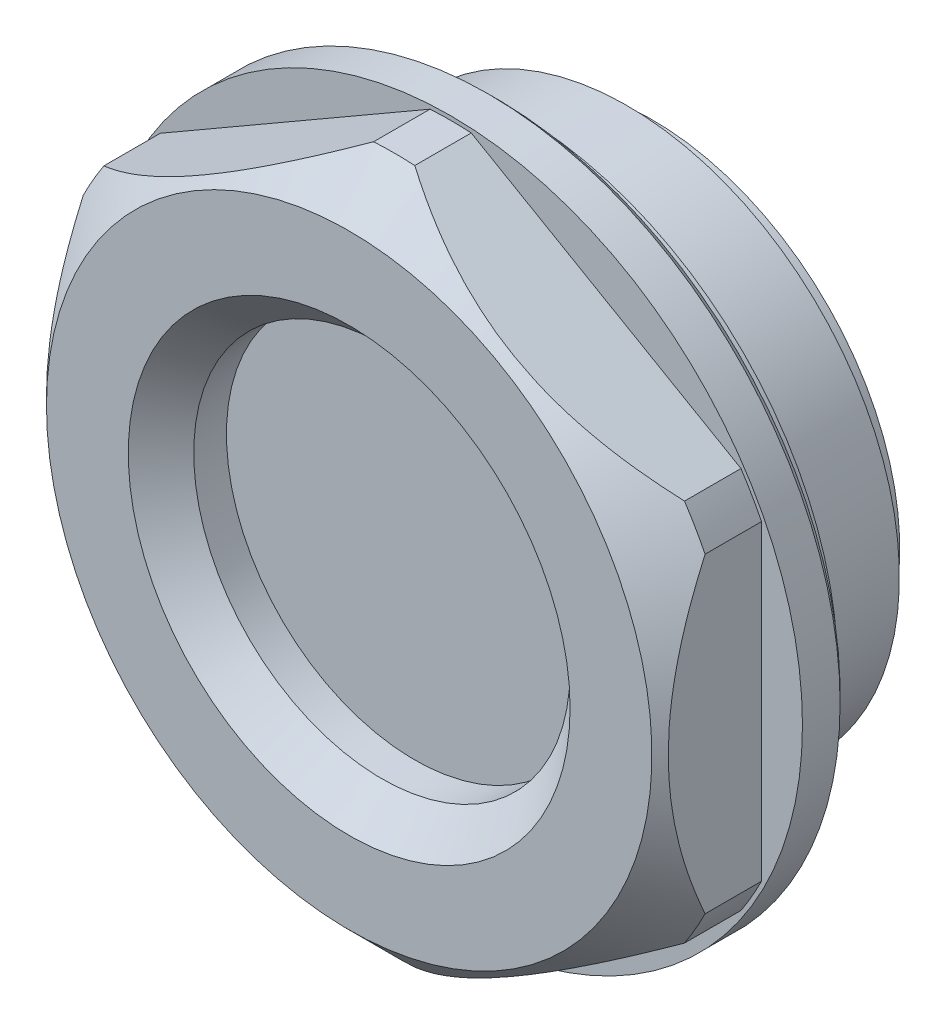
ISO-10303-21;
HEADER;
FILE_DESCRIPTION(('STEP AP214'),'2;1');
FILE_NAME('part.step','',(''),(''),'','','');
FILE_SCHEMA(('AUTOMOTIVE_DESIGN { 1 0 10303 214 1 1 1 1 }'));
ENDSEC;
DATA;
#1=APPLICATION_CONTEXT('core data for automotive mechanical design processes');
#2=APPLICATION_PROTOCOL_DEFINITION('international standard','automotive_design',2000,#1);
#3=PRODUCT_CONTEXT('',#1,'mechanical');
#4=PRODUCT('Part','Part','',(#3));
#5=PRODUCT_RELATED_PRODUCT_CATEGORY('part','',(#4));
#6=PRODUCT_DEFINITION_FORMATION('','',#4);
#7=PRODUCT_DEFINITION_CONTEXT('part definition',#1,'design');
#8=PRODUCT_DEFINITION('design','',#6,#7);
#9=PRODUCT_DEFINITION_SHAPE('','',#8);
#10=(LENGTH_UNIT() NAMED_UNIT(*) SI_UNIT(.MILLI.,.METRE.));
#11=(NAMED_UNIT(*) PLANE_ANGLE_UNIT() SI_UNIT($,.RADIAN.));
#12=(NAMED_UNIT(*) SI_UNIT($,.STERADIAN.) SOLID_ANGLE_UNIT());
#13=UNCERTAINTY_MEASURE_WITH_UNIT(LENGTH_MEASURE(1.E-05),#10,'distance_accuracy_value','');
#14=(GEOMETRIC_REPRESENTATION_CONTEXT(3) GLOBAL_UNCERTAINTY_ASSIGNED_CONTEXT((#13)) GLOBAL_UNIT_ASSIGNED_CONTEXT((#10,
#11,#12)) REPRESENTATION_CONTEXT('',''));
#15=CARTESIAN_POINT('',(0.,0.,0.));
#16=DIRECTION('',(0.,0.,1.));
#17=DIRECTION('',(1.,0.,0.));
#18=AXIS2_PLACEMENT_3D('',#15,#16,#17);
#19=CARTESIAN_POINT('',(0.,0.,-16.2872303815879));
#20=DIRECTION('',(0.,0.,-1.));
#21=DIRECTION('',(-1.,0.,0.));
#22=AXIS2_PLACEMENT_3D('',#19,#20,#21);
#23=CYLINDRICAL_SURFACE('',#22,21.25);
#24=CARTESIAN_POINT('',(0.,0.,7.45));
#25=DIRECTION('',(0.,0.,-1.));
#26=DIRECTION('',(-1.,0.,0.));
#27=AXIS2_PLACEMENT_3D('',#24,#25,#26);
#28=CIRCLE('',#27,21.25);
#29=CARTESIAN_POINT('',(1.25852709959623,-21.2126992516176,7.45));
#30=VERTEX_POINT('',#29);
#31=CARTESIAN_POINT('',(-1.25852709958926,-21.2126992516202,7.45));
#32=VERTEX_POINT('',#31);
#33=EDGE_CURVE('E146',#30,#32,#28,.T.);
#34=ORIENTED_EDGE('',*,*,#33,.T.);
#35=DIRECTION('',(0.,0.,1.));
#36=VECTOR('',#35,1.);
#37=CARTESIAN_POINT('',(-1.25852709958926,-21.2126992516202,3.9999999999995));
#38=LINE('',#37,#36);
#39=CARTESIAN_POINT('',(-1.25852709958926,-21.2126992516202,3.9999999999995));
#40=VERTEX_POINT('',#39);
#41=EDGE_CURVE('E126',#40,#32,#38,.T.);
#42=ORIENTED_EDGE('',*,*,#41,.F.);
#43=CARTESIAN_POINT('',(0.,0.,4.));
#44=DIRECTION('',(0.,0.,-1.));
#45=DIRECTION('',(-1.,0.,0.));
#46=AXIS2_PLACEMENT_3D('',#43,#44,#45);
#47=CIRCLE('',#46,21.25);
#48=CARTESIAN_POINT('',(1.25852709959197,-21.21269925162,3.9999999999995));
#49=VERTEX_POINT('',#48);
#50=EDGE_CURVE('E119',#49,#40,#47,.T.);
#51=ORIENTED_EDGE('',*,*,#50,.F.);
#52=DIRECTION('',(0.,0.,1.));
#53=VECTOR('',#52,1.);
#54=CARTESIAN_POINT('',(1.25852709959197,-21.21269925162,3.9999999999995));
#55=LINE('',#54,#53);
#56=EDGE_CURVE('E100',#49,#30,#55,.T.);
#57=ORIENTED_EDGE('',*,*,#56,.T.);
#58=EDGE_LOOP('',(#34,#42,#51,#57));
#59=FACE_BOUND('',#58,.T.);
#60=ADVANCED_FACE('F14',(#59),#23,.T.);
#61=CARTESIAN_POINT('',(-17.7414728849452,-11.696266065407,3.9999999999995));
#62=VERTEX_POINT('',#61);
#63=CARTESIAN_POINT('',(-18.9999999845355,-9.51643318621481,3.9999999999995));
#64=VERTEX_POINT('',#63);
#65=EDGE_CURVE('E127',#62,#64,#47,.T.);
#66=ORIENTED_EDGE('',*,*,#65,.F.);
#67=DIRECTION('',(0.,0.,1.));
#68=VECTOR('',#67,1.);
#69=CARTESIAN_POINT('',(-17.7414728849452,-11.696266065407,3.9999999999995));
#70=LINE('',#69,#68);
#71=CARTESIAN_POINT('',(-17.7414728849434,-11.696266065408,7.45));
#72=VERTEX_POINT('',#71);
#73=EDGE_CURVE('E302',#62,#72,#70,.T.);
#74=ORIENTED_EDGE('',*,*,#73,.T.);
#75=CARTESIAN_POINT('',(-18.9999999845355,-9.51643318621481,7.45));
#76=VERTEX_POINT('',#75);
#77=EDGE_CURVE('E134',#72,#76,#28,.T.);
#78=ORIENTED_EDGE('',*,*,#77,.T.);
#79=DIRECTION('',(0.,0.,1.));
#80=VECTOR('',#79,1.);
#81=CARTESIAN_POINT('',(-18.9999999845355,-9.51643318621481,3.9999999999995));
#82=LINE('',#81,#80);
#83=EDGE_CURVE('E303',#64,#76,#82,.T.);
#84=ORIENTED_EDGE('',*,*,#83,.F.);
#85=EDGE_LOOP('',(#66,#74,#78,#84));
#86=FACE_BOUND('',#85,.T.);
#87=ADVANCED_FACE('F290',(#86),#23,.T.);
#88=CARTESIAN_POINT('',(-18.9999999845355,9.51643318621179,3.9999999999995));
#89=VERTEX_POINT('',#88);
#90=CARTESIAN_POINT('',(-17.7414728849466,11.6962660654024,3.9999999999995));
#91=VERTEX_POINT('',#90);
#92=EDGE_CURVE('E132',#89,#91,#47,.T.);
#93=ORIENTED_EDGE('',*,*,#92,.F.);
#94=DIRECTION('',(0.,0.,1.));
#95=VECTOR('',#94,1.);
#96=CARTESIAN_POINT('',(-18.9999999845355,9.51643318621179,3.9999999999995));
#97=LINE('',#96,#95);
#98=CARTESIAN_POINT('',(-18.9999999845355,9.51643318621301,7.45));
#99=VERTEX_POINT('',#98);
#100=EDGE_CURVE('E324',#89,#99,#97,.T.);
#101=ORIENTED_EDGE('',*,*,#100,.T.);
#102=CARTESIAN_POINT('',(-17.7414728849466,11.6962660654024,7.45));
#103=VERTEX_POINT('',#102);
#104=EDGE_CURVE('E22',#99,#103,#28,.T.);
#105=ORIENTED_EDGE('',*,*,#104,.T.);
#106=DIRECTION('',(0.,0.,1.));
#107=VECTOR('',#106,1.);
#108=CARTESIAN_POINT('',(-17.7414728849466,11.6962660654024,3.9999999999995));
#109=LINE('',#108,#107);
#110=EDGE_CURVE('E322',#91,#103,#109,.T.);
#111=ORIENTED_EDGE('',*,*,#110,.F.);
#112=EDGE_LOOP('',(#93,#101,#105,#111));
#113=FACE_BOUND('',#112,.T.);
#114=ADVANCED_FACE('F295',(#113),#23,.T.);
#115=CARTESIAN_POINT('',(-1.25852709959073,21.212699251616,3.9999999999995));
#116=VERTEX_POINT('',#115);
#117=CARTESIAN_POINT('',(1.2585270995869,21.212699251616,3.9999999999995));
#118=VERTEX_POINT('',#117);
#119=EDGE_CURVE('E135',#116,#118,#47,.T.);
#120=ORIENTED_EDGE('',*,*,#119,.F.);
#121=DIRECTION('',(0.,0.,1.));
#122=VECTOR('',#121,1.);
#123=CARTESIAN_POINT('',(-1.25852709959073,21.212699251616,3.9999999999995));
#124=LINE('',#123,#122);
#125=CARTESIAN_POINT('',(-1.25852709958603,21.2126992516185,7.45));
#126=VERTEX_POINT('',#125);
#127=EDGE_CURVE('E319',#116,#126,#124,.T.);
#128=ORIENTED_EDGE('',*,*,#127,.T.);
#129=CARTESIAN_POINT('',(1.2585270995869,21.212699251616,7.45));
#130=VERTEX_POINT('',#129);
#131=EDGE_CURVE('E138',#126,#130,#28,.T.);
#132=ORIENTED_EDGE('',*,*,#131,.T.);
#133=DIRECTION('',(0.,0.,1.));
#134=VECTOR('',#133,1.);
#135=CARTESIAN_POINT('',(1.2585270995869,21.212699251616,3.9999999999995));
#136=LINE('',#135,#134);
#137=EDGE_CURVE('E317',#118,#130,#136,.T.);
#138=ORIENTED_EDGE('',*,*,#137,.F.);
#139=EDGE_LOOP('',(#120,#128,#132,#138));
#140=FACE_BOUND('',#139,.T.);
#141=ADVANCED_FACE('F300',(#140),#23,.T.);
#142=CARTESIAN_POINT('',(17.7414728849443,11.6962660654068,3.9999999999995));
#143=VERTEX_POINT('',#142);
#144=CARTESIAN_POINT('',(18.999999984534,9.51643318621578,3.9999999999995));
#145=VERTEX_POINT('',#144);
#146=EDGE_CURVE('E129',#143,#145,#47,.T.);
#147=ORIENTED_EDGE('',*,*,#146,.F.);
#148=DIRECTION('',(0.,0.,1.));
#149=VECTOR('',#148,1.);
#150=CARTESIAN_POINT('',(17.7414728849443,11.6962660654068,3.9999999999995));
#151=LINE('',#150,#149);
#152=CARTESIAN_POINT('',(17.7414728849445,11.6962660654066,7.45));
#153=VERTEX_POINT('',#152);
#154=EDGE_CURVE('E164',#143,#153,#151,.T.);
#155=ORIENTED_EDGE('',*,*,#154,.T.);
#156=CARTESIAN_POINT('',(18.999999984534,9.51643318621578,7.45));
#157=VERTEX_POINT('',#156);
#158=EDGE_CURVE('E144',#153,#157,#28,.T.);
#159=ORIENTED_EDGE('',*,*,#158,.T.);
#160=DIRECTION('',(0.,0.,1.));
#161=VECTOR('',#160,1.);
#162=CARTESIAN_POINT('',(18.999999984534,9.51643318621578,3.9999999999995));
#163=LINE('',#162,#161);
#164=EDGE_CURVE('E162',#145,#157,#163,.T.);
#165=ORIENTED_EDGE('',*,*,#164,.F.);
#166=EDGE_LOOP('',(#147,#155,#159,#165));
#167=FACE_BOUND('',#166,.T.);
#168=ADVANCED_FACE('F161',(#167),#23,.T.);
#169=CARTESIAN_POINT('',(0.,18.5,10.2));
#170=DIRECTION('',(0.,0.,1.));
#171=DIRECTION('',(1.,0.,0.));
#172=AXIS2_PLACEMENT_3D('',#169,#170,#171);
#173=PLANE('',#172);
#174=CARTESIAN_POINT('',(0.,0.,10.2));
#175=DIRECTION('',(0.,0.,1.));
#176=DIRECTION('',(1.,0.,0.));
#177=AXIS2_PLACEMENT_3D('',#174,#175,#176);
#178=CIRCLE('',#177,13.5);
#179=CARTESIAN_POINT('',(13.5,0.,10.2));
#180=VERTEX_POINT('',#179);
#181=EDGE_CURVE('E330',#180,#180,#178,.T.);
#182=ORIENTED_EDGE('',*,*,#181,.F.);
#183=EDGE_LOOP('',(#182));
#184=FACE_BOUND('',#183,.T.);
#185=CARTESIAN_POINT('',(0.,0.,10.2));
#186=DIRECTION('',(0.,0.,-1.));
#187=DIRECTION('',(-1.,0.,0.));
#188=AXIS2_PLACEMENT_3D('',#185,#186,#187);
#189=CIRCLE('',#188,18.5);
#190=CARTESIAN_POINT('',(-18.5,0.,10.2));
#191=VERTEX_POINT('',#190);
#192=EDGE_CURVE('E9',#191,#191,#189,.T.);
#193=ORIENTED_EDGE('',*,*,#192,.F.);
#194=EDGE_LOOP('',(#193));
#195=FACE_BOUND('',#194,.T.);
#196=ADVANCED_FACE('F16',(#184,#195),#173,.T.);
#197=CARTESIAN_POINT('',(0.,0.,7.45));
#198=DIRECTION('',(0.,0.,-1.));
#199=DIRECTION('',(-1.,0.,0.));
#200=AXIS2_PLACEMENT_3D('',#197,#198,#199);
#201=CONICAL_SURFACE('',#200,21.25,0.785398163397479);
#202=CARTESIAN_POINT('',(-1.25832709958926,-21.212814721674,7.44989657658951));
#203=CARTESIAN_POINT('',(-1.84415176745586,-20.8745886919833,7.75282696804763));
#204=CARTESIAN_POINT('',(-2.43924641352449,-20.5310106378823,8.03478739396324));
#205=CARTESIAN_POINT('',(-3.64893508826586,-19.8325965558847,8.5450370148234));
#206=CARTESIAN_POINT('',(-4.26359583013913,-19.4777220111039,8.7731136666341));
#207=CARTESIAN_POINT('',(-5.1938483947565,-18.9406404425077,9.06312422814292));
#208=CARTESIAN_POINT('',(-5.50343493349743,-18.7619005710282,9.15073876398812));
#209=CARTESIAN_POINT('',(-6.12606595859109,-18.4024243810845,9.30786500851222));
#210=CARTESIAN_POINT('',(-6.43911052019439,-18.2216880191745,9.37737632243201));
#211=CARTESIAN_POINT('',(-7.06751055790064,-17.858881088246,9.4968364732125));
#212=CARTESIAN_POINT('',(-7.38286177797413,-17.6768129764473,9.54681500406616));
#213=CARTESIAN_POINT('',(-8.0155008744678,-17.3115586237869,9.6262871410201));
#214=CARTESIAN_POINT('',(-8.33278869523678,-17.1283724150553,9.65578133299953));
#215=CARTESIAN_POINT('',(-8.94580863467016,-16.7744451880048,9.69227656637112));
#216=CARTESIAN_POINT('',(-9.24147657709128,-16.6037412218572,9.70072217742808));
#217=CARTESIAN_POINT('',(-9.832760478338,-16.2623633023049,9.6991811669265));
#218=CARTESIAN_POINT('',(-10.1283764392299,-16.0916893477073,9.68919566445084));
#219=CARTESIAN_POINT('',(-10.7188510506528,-15.7507786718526,9.65098742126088));
#220=CARTESIAN_POINT('',(-11.0137093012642,-15.5805421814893,9.62275648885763));
#221=CARTESIAN_POINT('',(-11.6017855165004,-15.2410162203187,9.54860152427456));
#222=CARTESIAN_POINT('',(-11.8950032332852,-15.0717268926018,9.50267488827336));
#223=CARTESIAN_POINT('',(-12.4789781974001,-14.7345687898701,9.39399755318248));
#224=CARTESIAN_POINT('',(-12.7697362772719,-14.566699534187,9.3312528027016));
#225=CARTESIAN_POINT('',(-13.3483804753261,-14.2326191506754,9.1900026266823));
#226=CARTESIAN_POINT('',(-13.6362661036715,-14.0664083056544,9.1114945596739));
#227=CARTESIAN_POINT('',(-14.49509319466,-13.5705642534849,8.85407883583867));
#228=CARTESIAN_POINT('',(-15.0612224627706,-13.2437093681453,8.65327625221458));
#229=CARTESIAN_POINT('',(-15.7999695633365,-12.8171935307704,8.35592574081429));
#230=CARTESIAN_POINT('',(-15.9793907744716,-12.7136046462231,8.280889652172));
#231=CARTESIAN_POINT('',(-16.3366658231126,-12.5073318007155,8.12614571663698));
#232=CARTESIAN_POINT('',(-16.5145201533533,-12.4046475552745,8.04643940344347));
#233=CARTESIAN_POINT('',(-16.8680992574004,-12.2005085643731,7.88293260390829));
#234=CARTESIAN_POINT('',(-17.0438292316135,-12.0990508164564,7.79914703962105));
#235=CARTESIAN_POINT('',(-17.3938418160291,-11.8969709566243,7.62750131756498));
#236=CARTESIAN_POINT('',(-17.5681240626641,-11.7963490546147,7.53964017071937));
#237=CARTESIAN_POINT('',(-17.7416728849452,-11.6961505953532,7.44989657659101));
#238=B_SPLINE_CURVE_WITH_KNOTS('',3,(#202,#203,#204,#205,#206,#207,#208,#209,#210,#211,#212,
#213,#214,#215,#216,#217,#218,#219,#220,#221,#222,#223,#224,#225,#226,#227,#228,#229,#230,#231,
#232,#233,#234,#235,#236,#237),.UNSPECIFIED.,.F.,.F.,(4,2,2,2,2,2,2,2,2,2,2,2,2,2,2,2,2,4),(0.,
2.22511924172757,4.45887409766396,5.56263346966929,6.66641690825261,7.76851577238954,
8.87058311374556,9.89463020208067,10.9186151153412,11.9430600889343,12.9676558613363,
13.9918897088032,15.0162953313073,17.0650449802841,17.726075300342,18.3868897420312,
19.0454459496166,19.7041628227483),.UNSPECIFIED.);
#239=EDGE_CURVE('E29',#32,#72,#238,.T.);
#240=ORIENTED_EDGE('',*,*,#239,.F.);
#241=ORIENTED_EDGE('',*,*,#33,.F.);
#242=CARTESIAN_POINT('',(17.7416728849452,-11.6961505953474,7.44989657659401));
#243=CARTESIAN_POINT('',(17.155848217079,-12.0343766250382,7.75282696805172));
#244=CARTESIAN_POINT('',(16.5607535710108,-12.3779546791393,8.03478739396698));
#245=CARTESIAN_POINT('',(15.3510648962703,-13.0763687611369,8.54503701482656));
#246=CARTESIAN_POINT('',(14.7364041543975,-13.4312433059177,8.77311366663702));
#247=CARTESIAN_POINT('',(13.8061515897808,-13.9683248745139,9.06312422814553));
#248=CARTESIAN_POINT('',(13.4965650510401,-14.1470647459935,9.15073876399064));
#249=CARTESIAN_POINT('',(12.8739340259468,-14.5065409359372,9.30786500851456));
#250=CARTESIAN_POINT('',(12.5608894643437,-14.6872772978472,9.37737632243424));
#251=CARTESIAN_POINT('',(11.9324894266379,-15.0500842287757,9.49683647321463));
#252=CARTESIAN_POINT('',(11.6171382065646,-15.2321523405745,9.54681500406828));
#253=CARTESIAN_POINT('',(10.9844991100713,-15.597406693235,9.62628714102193));
#254=CARTESIAN_POINT('',(10.6672112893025,-15.7805929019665,9.65578133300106));
#255=CARTESIAN_POINT('',(10.0541913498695,-16.134520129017,9.69227656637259));
#256=CARTESIAN_POINT('',(9.75852340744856,-16.3052240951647,9.70072217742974));
#257=CARTESIAN_POINT('',(9.1672395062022,-16.6466020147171,9.69918116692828));
#258=CARTESIAN_POINT('',(8.87162354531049,-16.8172759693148,9.68919566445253));
#259=CARTESIAN_POINT('',(8.2811489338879,-17.1581866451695,9.6509874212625));
#260=CARTESIAN_POINT('',(7.98629068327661,-17.3284231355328,9.62275648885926));
#261=CARTESIAN_POINT('',(7.39821446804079,-17.6679490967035,9.54860152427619));
#262=CARTESIAN_POINT('',(7.10499675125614,-17.8372384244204,9.50267488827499));
#263=CARTESIAN_POINT('',(6.5210217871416,-18.1743965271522,9.39399755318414));
#264=CARTESIAN_POINT('',(6.23026370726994,-18.3422657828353,9.3312528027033));
#265=CARTESIAN_POINT('',(5.65161950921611,-18.6763461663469,9.190002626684));
#266=CARTESIAN_POINT('',(5.36373388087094,-18.842557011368,9.11149455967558));
#267=CARTESIAN_POINT('',(4.50490678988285,-19.3384010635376,8.85407883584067));
#268=CARTESIAN_POINT('',(3.93877752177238,-19.6652559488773,8.65327625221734));
#269=CARTESIAN_POINT('',(3.20003042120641,-20.0917717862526,8.35592574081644));
#270=CARTESIAN_POINT('',(3.02060921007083,-20.1953606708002,8.28088965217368));
#271=CARTESIAN_POINT('',(2.6633341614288,-20.4016335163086,8.12614571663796));
#272=CARTESIAN_POINT('',(2.48547983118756,-20.50431776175,8.04643940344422));
#273=CARTESIAN_POINT('',(2.13190072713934,-20.7084567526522,7.8829326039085));
#274=CARTESIAN_POINT('',(1.95617075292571,-20.8099145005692,7.79914703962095));
#275=CARTESIAN_POINT('',(1.60615816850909,-21.0119943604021,7.6275013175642));
#276=CARTESIAN_POINT('',(1.43187592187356,-21.1126162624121,7.53964017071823));
#277=CARTESIAN_POINT('',(1.25832709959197,-21.212814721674,7.44989657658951));
#278=B_SPLINE_CURVE_WITH_KNOTS('',3,(#242,#243,#244,#245,#246,#247,#248,#249,#250,#251,#252,
#253,#254,#255,#256,#257,#258,#259,#260,#261,#262,#263,#264,#265,#266,#267,#268,#269,#270,#271,
#272,#273,#274,#275,#276,#277),.UNSPECIFIED.,.F.,.F.,(4,2,2,2,2,2,2,2,2,2,2,2,2,2,2,2,2,4),(0.,
2.22511924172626,4.4588740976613,5.5626334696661,6.66641690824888,7.76851577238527,
8.87058311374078,9.89463020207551,10.9186151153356,11.9430600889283,12.96765586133,
13.9918897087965,15.0162953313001,17.0650449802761,17.7260753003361,18.3868897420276,
19.0454459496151,19.704162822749),.UNSPECIFIED.);
#279=CARTESIAN_POINT('',(17.7414728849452,-11.6962660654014,7.45));
#280=VERTEX_POINT('',#279);
#281=EDGE_CURVE('E37',#280,#30,#278,.T.);
#282=ORIENTED_EDGE('',*,*,#281,.F.);
#283=CARTESIAN_POINT('',(18.999999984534,-9.51643318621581,7.45));
#284=VERTEX_POINT('',#283);
#285=EDGE_CURVE('E150',#284,#280,#28,.T.);
#286=ORIENTED_EDGE('',*,*,#285,.F.);
#287=CARTESIAN_POINT('',(18.999999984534,-20.2612702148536,0.92376789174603));
#288=CARTESIAN_POINT('',(18.999999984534,-20.0110830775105,1.10626271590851));
#289=CARTESIAN_POINT('',(18.999999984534,-19.7601467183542,1.28772943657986));
#290=CARTESIAN_POINT('',(18.999999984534,-19.2566590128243,1.64841900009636));
#291=CARTESIAN_POINT('',(18.999999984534,-19.0041076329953,1.82764179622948));
#292=CARTESIAN_POINT('',(18.999999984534,-18.2437428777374,2.36174200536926));
#293=CARTESIAN_POINT('',(18.999999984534,-17.7333460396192,2.71295821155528));
#294=CARTESIAN_POINT('',(18.999999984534,-16.7007528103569,3.40637143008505));
#295=CARTESIAN_POINT('',(18.999999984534,-16.1784959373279,3.74847858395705));
#296=CARTESIAN_POINT('',(18.999999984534,-15.1249024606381,4.41837456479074));
#297=CARTESIAN_POINT('',(18.999999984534,-14.5935665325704,4.74616445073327));
#298=CARTESIAN_POINT('',(18.999999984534,-13.4950575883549,5.39951960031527));
#299=CARTESIAN_POINT('',(18.999999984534,-12.9273803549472,5.72424140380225));
#300=CARTESIAN_POINT('',(18.999999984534,-11.7790350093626,6.350192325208));
#301=CARTESIAN_POINT('',(18.999999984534,-11.1983650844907,6.65141813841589));
#302=CARTESIAN_POINT('',(18.999999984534,-10.0244276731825,7.22379665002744));
#303=CARTESIAN_POINT('',(18.999999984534,-9.43120303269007,7.49503655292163));
#304=CARTESIAN_POINT('',(18.999999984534,-8.22966444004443,8.00142854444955));
#305=CARTESIAN_POINT('',(18.999999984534,-7.62135686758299,8.23659559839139));
#306=CARTESIAN_POINT('',(18.999999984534,-6.41591166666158,8.65359972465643));
#307=CARTESIAN_POINT('',(18.999999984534,-5.81942445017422,8.83729994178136));
#308=CARTESIAN_POINT('',(18.999999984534,-4.6133561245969,9.15657225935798));
#309=CARTESIAN_POINT('',(18.999999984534,-4.00377401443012,9.29214066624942));
#310=CARTESIAN_POINT('',(18.999999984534,-3.08715860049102,9.45313749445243));
#311=CARTESIAN_POINT('',(18.999999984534,-2.78371632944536,9.49953391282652));
#312=CARTESIAN_POINT('',(18.999999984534,-2.17502726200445,9.5782905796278));
#313=CARTESIAN_POINT('',(18.999999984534,-1.86978068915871,9.61065253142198));
#314=CARTESIAN_POINT('',(18.999999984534,-1.25810482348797,9.6608323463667));
#315=CARTESIAN_POINT('',(18.999999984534,-0.951675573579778,9.67865073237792));
#316=CARTESIAN_POINT('',(18.999999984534,-0.338311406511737,9.699459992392));
#317=CARTESIAN_POINT('',(18.999999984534,-0.0313764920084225,9.7024509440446));
#318=CARTESIAN_POINT('',(18.999999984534,0.574158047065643,9.69367367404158));
#319=CARTESIAN_POINT('',(18.999999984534,0.872763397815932,9.68229375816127));
#320=CARTESIAN_POINT('',(18.999999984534,1.46914533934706,9.64560971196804));
#321=CARTESIAN_POINT('',(18.999999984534,1.76692183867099,9.62030410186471));
#322=CARTESIAN_POINT('',(18.999999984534,2.36099800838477,9.55614661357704));
#323=CARTESIAN_POINT('',(18.999999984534,2.65729773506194,9.51729525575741));
#324=CARTESIAN_POINT('',(18.999999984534,3.24791524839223,9.42660590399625));
#325=CARTESIAN_POINT('',(18.999999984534,3.54223279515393,9.37476636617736));
#326=CARTESIAN_POINT('',(18.999999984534,4.43110933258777,9.19886889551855));
#327=CARTESIAN_POINT('',(18.999999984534,5.02192758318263,9.05550717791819));
#328=CARTESIAN_POINT('',(18.999999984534,6.19074825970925,8.72474904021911));
#329=CARTESIAN_POINT('',(18.999999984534,6.76875224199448,8.53735800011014));
#330=CARTESIAN_POINT('',(18.999999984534,8.0037218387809,8.0923277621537));
#331=CARTESIAN_POINT('',(18.999999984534,8.65834514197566,7.82822936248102));
#332=CARTESIAN_POINT('',(18.999999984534,9.95017519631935,7.26010526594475));
#333=CARTESIAN_POINT('',(18.999999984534,10.587373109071,6.95605974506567));
#334=CARTESIAN_POINT('',(18.999999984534,11.8477146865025,6.31534228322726));
#335=CARTESIAN_POINT('',(18.999999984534,12.4708039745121,5.97856421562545));
#336=CARTESIAN_POINT('',(18.999999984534,13.7025022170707,5.2798931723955));
#337=CARTESIAN_POINT('',(18.999999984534,14.3111136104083,4.91800446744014));
#338=CARTESIAN_POINT('',(18.999999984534,15.4852068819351,4.1930721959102));
#339=CARTESIAN_POINT('',(18.999999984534,16.0513072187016,3.83102507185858));
#340=CARTESIAN_POINT('',(18.999999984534,17.1738153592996,3.09216076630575));
#341=CARTESIAN_POINT('',(18.999999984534,17.7302224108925,2.71534244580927));
#342=CARTESIAN_POINT('',(18.999999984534,18.8300227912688,1.95277426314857));
#343=CARTESIAN_POINT('',(18.999999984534,19.3734858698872,1.56712476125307));
#344=CARTESIAN_POINT('',(18.999999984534,20.183217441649,0.981276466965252));
#345=CARTESIAN_POINT('',(18.999999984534,20.4521836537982,0.784790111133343));
#346=CARTESIAN_POINT('',(18.999999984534,20.9884362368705,0.389548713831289));
#347=CARTESIAN_POINT('',(18.999999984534,21.2557226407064,0.19079371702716));
#348=CARTESIAN_POINT('',(18.999999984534,21.522233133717,-0.00899716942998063));
#349=B_SPLINE_CURVE_WITH_KNOTS('',3,(#287,#288,#289,#290,#291,#292,#293,#294,#295,#296,#297,
#298,#299,#300,#301,#302,#303,#304,#305,#306,#307,#308,#309,#310,#311,#312,#313,#314,#315,#316,
#317,#318,#319,#320,#321,#322,#323,#324,#325,#326,#327,#328,#329,#330,#331,#332,#333,#334,#335,
#336,#337,#338,#339,#340,#341,#342,#343,#344,#345,#346,#347,#348),.UNSPECIFIED.,.F.,.F.,(4,2,2,
2,2,2,2,2,2,2,2,2,2,2,2,2,2,2,2,2,2,2,2,2,2,2,2,2,2,2,4),(0.,0.929017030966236,1.85805336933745,
3.71659862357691,5.58940144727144,7.46206551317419,9.42358086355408,11.3853716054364,
13.3412980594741,15.2964108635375,17.1671712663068,19.0380751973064,19.9587097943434,
20.879232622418,21.7997223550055,22.7202072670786,23.6163442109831,24.5125763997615,
25.4087741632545,26.3050785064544,28.126761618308,29.948222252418,32.0641692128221,
34.181170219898,36.3052798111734,38.4290290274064,40.4446752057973,42.4604771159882,
44.4595121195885,45.4587758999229,46.4580200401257),.UNSPECIFIED.);
#350=EDGE_CURVE('E172',#157,#284,#349,.F.);
#351=ORIENTED_EDGE('',*,*,#350,.F.);
#352=ORIENTED_EDGE('',*,*,#158,.F.);
#353=CARTESIAN_POINT('',(1.2583270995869,21.21281472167,7.44989657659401));
#354=CARTESIAN_POINT('',(1.84415176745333,20.8745886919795,7.75282696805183));
#355=CARTESIAN_POINT('',(2.4392464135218,20.5310106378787,8.0347873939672));
#356=CARTESIAN_POINT('',(3.64893508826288,19.8325965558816,8.545037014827));
#357=CARTESIAN_POINT('',(4.26359583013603,19.477722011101,8.77311366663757));
#358=CARTESIAN_POINT('',(5.1938483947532,18.9406404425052,9.06312422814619));
#359=CARTESIAN_POINT('',(5.50343493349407,18.7619005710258,9.15073876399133));
#360=CARTESIAN_POINT('',(6.12606595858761,18.4024243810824,9.30786500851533));
#361=CARTESIAN_POINT('',(6.43911052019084,18.2216880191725,9.37737632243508));
#362=CARTESIAN_POINT('',(7.06751055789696,17.8588810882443,9.49683647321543));
#363=CARTESIAN_POINT('',(7.3828617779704,17.6768129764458,9.546815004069));
#364=CARTESIAN_POINT('',(8.01550087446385,17.3115586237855,9.626287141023));
#365=CARTESIAN_POINT('',(8.33278869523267,17.128372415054,9.65578133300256));
#366=CARTESIAN_POINT('',(8.94580863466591,16.7744451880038,9.69227656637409));
#367=CARTESIAN_POINT('',(9.24147657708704,16.6037412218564,9.70072217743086));
#368=CARTESIAN_POINT('',(9.83276047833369,16.2623633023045,9.69918116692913));
#369=CARTESIAN_POINT('',(10.1283764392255,16.0916893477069,9.6891956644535));
#370=CARTESIAN_POINT('',(10.7188510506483,15.7507786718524,9.65098742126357));
#371=CARTESIAN_POINT('',(11.0137093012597,15.5805421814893,9.6227564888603));
#372=CARTESIAN_POINT('',(11.6017855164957,15.2410162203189,9.54860152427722));
#373=CARTESIAN_POINT('',(11.8950032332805,15.0717268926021,9.50267488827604));
#374=CARTESIAN_POINT('',(12.4789781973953,14.7345687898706,9.3939975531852));
#375=CARTESIAN_POINT('',(12.769736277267,14.5666995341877,9.33125280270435));
#376=CARTESIAN_POINT('',(13.3483804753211,14.2326191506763,9.19000262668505));
#377=CARTESIAN_POINT('',(13.6362661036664,14.0664083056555,9.11149455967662));
#378=CARTESIAN_POINT('',(14.4950931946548,13.5705642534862,8.8540788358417));
#379=CARTESIAN_POINT('',(15.0612224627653,13.2437093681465,8.65327625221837));
#380=CARTESIAN_POINT('',(15.7999695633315,12.8171935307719,8.35592574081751));
#381=CARTESIAN_POINT('',(15.9793907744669,12.7136046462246,8.28088965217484));
#382=CARTESIAN_POINT('',(16.3366658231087,12.5073318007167,8.12614571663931));
#383=CARTESIAN_POINT('',(16.5145201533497,12.4046475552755,8.04643940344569));
#384=CARTESIAN_POINT('',(16.8680992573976,12.2005085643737,7.88293260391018));
#385=CARTESIAN_POINT('',(17.0438292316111,12.0990508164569,7.79914703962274));
#386=CARTESIAN_POINT('',(17.3938418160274,11.8969709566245,7.62750131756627));
#387=CARTESIAN_POINT('',(17.5681240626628,11.7963490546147,7.53964017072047));
#388=CARTESIAN_POINT('',(17.7416728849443,11.696150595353,7.44989657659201));
#389=B_SPLINE_CURVE_WITH_KNOTS('',3,(#353,#354,#355,#356,#357,#358,#359,#360,#361,#362,#363,
#364,#365,#366,#367,#368,#369,#370,#371,#372,#373,#374,#375,#376,#377,#378,#379,#380,#381,#382,
#383,#384,#385,#386,#387,#388),.UNSPECIFIED.,.F.,.F.,(4,2,2,2,2,2,2,2,2,2,2,2,2,2,2,2,2,4),(0.,
2.22511924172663,4.45887409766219,5.56263346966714,6.66641690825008,7.7685157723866,
8.87058311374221,9.89463020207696,10.9186151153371,11.9430600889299,12.9676558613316,
13.9918897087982,15.0162953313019,17.0650449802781,17.7260753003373,18.3868897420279,
19.0454459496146,19.7041628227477),.UNSPECIFIED.);
#390=EDGE_CURVE('E171',#130,#153,#389,.T.);
#391=ORIENTED_EDGE('',*,*,#390,.F.);
#392=ORIENTED_EDGE('',*,*,#131,.F.);
#393=CARTESIAN_POINT('',(-17.7416728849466,11.6961505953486,7.44989657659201));
#394=CARTESIAN_POINT('',(-17.15584821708,12.0343766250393,7.75282696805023));
#395=CARTESIAN_POINT('',(-16.5607535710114,12.3779546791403,8.0347873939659));
#396=CARTESIAN_POINT('',(-15.3510648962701,13.0763687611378,8.54503701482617));
#397=CARTESIAN_POINT('',(-14.7364041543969,13.4312433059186,8.77311366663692));
#398=CARTESIAN_POINT('',(-13.8061515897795,13.9683248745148,9.06312422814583));
#399=CARTESIAN_POINT('',(-13.4965650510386,14.1470647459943,9.15073876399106));
#400=CARTESIAN_POINT('',(-12.8739340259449,14.506540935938,9.30786500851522));
#401=CARTESIAN_POINT('',(-12.5608894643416,14.687277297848,9.37737632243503));
#402=CARTESIAN_POINT('',(-11.9324894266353,15.0500842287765,9.4968364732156));
#403=CARTESIAN_POINT('',(-11.6171382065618,15.2321523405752,9.54681500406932));
#404=CARTESIAN_POINT('',(-10.9844991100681,15.5974066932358,9.62628714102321));
#405=CARTESIAN_POINT('',(-10.6672112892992,15.7805929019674,9.6557813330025));
#406=CARTESIAN_POINT('',(-10.0541913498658,16.1345201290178,9.69227656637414));
#407=CARTESIAN_POINT('',(-9.75852340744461,16.3052240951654,9.70072217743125));
#408=CARTESIAN_POINT('',(-9.16723950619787,16.6466020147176,9.69918116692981));
#409=CARTESIAN_POINT('',(-8.87162354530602,16.8172759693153,9.68919566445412));
#410=CARTESIAN_POINT('',(-8.28114893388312,17.15818664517,9.65098742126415));
#411=CARTESIAN_POINT('',(-7.98629068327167,17.3284231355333,9.62275648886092));
#412=CARTESIAN_POINT('',(-7.39821446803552,17.6679490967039,9.54860152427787));
#413=CARTESIAN_POINT('',(-7.10499675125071,17.8372384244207,9.50267488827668));
#414=CARTESIAN_POINT('',(-6.52102178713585,18.1743965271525,9.39399755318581));
#415=CARTESIAN_POINT('',(-6.23026370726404,18.3422657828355,9.33125280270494));
#416=CARTESIAN_POINT('',(-5.65161950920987,18.6763461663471,9.19000262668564));
#417=CARTESIAN_POINT('',(-5.3637338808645,18.8425570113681,9.11149455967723));
#418=CARTESIAN_POINT('',(-4.50490678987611,19.3384010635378,8.85407883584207));
#419=CARTESIAN_POINT('',(-3.93877752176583,19.665255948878,8.65327625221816));
#420=CARTESIAN_POINT('',(-3.20003042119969,20.0917717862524,8.35592574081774));
#421=CARTESIAN_POINT('',(-3.02060921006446,20.1953606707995,8.28088965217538));
#422=CARTESIAN_POINT('',(-2.66333416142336,20.401633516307,8.12614571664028));
#423=CARTESIAN_POINT('',(-2.48547983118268,20.504317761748,8.04643940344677));
#424=CARTESIAN_POINT('',(-2.13190072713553,20.7084567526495,7.88293260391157));
#425=CARTESIAN_POINT('',(-1.9561707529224,20.8099145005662,7.79914703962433));
#426=CARTESIAN_POINT('',(-1.60615816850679,21.0119943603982,7.62750131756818));
#427=CARTESIAN_POINT('',(-1.43187592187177,21.112616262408,7.5396401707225));
#428=CARTESIAN_POINT('',(-1.25832709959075,21.2128147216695,7.44989657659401));
#429=B_SPLINE_CURVE_WITH_KNOTS('',3,(#393,#394,#395,#396,#397,#398,#399,#400,#401,#402,#403,
#404,#405,#406,#407,#408,#409,#410,#411,#412,#413,#414,#415,#416,#417,#418,#419,#420,#421,#422,
#423,#424,#425,#426,#427,#428),.UNSPECIFIED.,.F.,.F.,(4,2,2,2,2,2,2,2,2,2,2,2,2,2,2,2,2,4),(0.,
2.22511924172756,4.45887409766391,5.5626334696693,6.66641690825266,7.76851577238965,
8.87058311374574,9.89463020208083,10.9186151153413,11.9430600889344,12.9676558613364,
13.9918897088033,15.0162953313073,17.065044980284,17.726075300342,18.3868897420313,
19.0454459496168,19.7041628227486),.UNSPECIFIED.);
#430=EDGE_CURVE('E175',#103,#126,#429,.T.);
#431=ORIENTED_EDGE('',*,*,#430,.F.);
#432=ORIENTED_EDGE('',*,*,#104,.F.);
#433=CARTESIAN_POINT('',(-18.9999999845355,-20.261270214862,0.923767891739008));
#434=CARTESIAN_POINT('',(-18.9999999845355,-20.0110830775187,1.10626271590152));
#435=CARTESIAN_POINT('',(-18.9999999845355,-19.7601467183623,1.28772943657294));
#436=CARTESIAN_POINT('',(-18.9999999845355,-19.2566590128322,1.64841900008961));
#437=CARTESIAN_POINT('',(-18.9999999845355,-19.0041076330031,1.82764179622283));
#438=CARTESIAN_POINT('',(-18.9999999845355,-18.2437428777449,2.36174200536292));
#439=CARTESIAN_POINT('',(-18.9999999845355,-17.7333460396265,2.71295821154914));
#440=CARTESIAN_POINT('',(-18.9999999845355,-16.7007528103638,3.40637143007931));
#441=CARTESIAN_POINT('',(-18.9999999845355,-16.1784959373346,3.74847858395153));
#442=CARTESIAN_POINT('',(-18.9999999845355,-15.1249024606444,4.41837456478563));
#443=CARTESIAN_POINT('',(-18.9999999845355,-14.5935665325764,4.74616445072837));
#444=CARTESIAN_POINT('',(-18.9999999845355,-13.4950575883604,5.39951960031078));
#445=CARTESIAN_POINT('',(-18.9999999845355,-12.9273803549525,5.72424140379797));
#446=CARTESIAN_POINT('',(-18.9999999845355,-11.7790350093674,6.35019232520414));
#447=CARTESIAN_POINT('',(-18.9999999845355,-11.1983650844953,6.65141813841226));
#448=CARTESIAN_POINT('',(-18.9999999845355,-10.0244276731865,7.22379665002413));
#449=CARTESIAN_POINT('',(-18.9999999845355,-9.43120303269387,7.49503655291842));
#450=CARTESIAN_POINT('',(-18.9999999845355,-8.22966444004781,8.00142854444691));
#451=CARTESIAN_POINT('',(-18.9999999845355,-7.62135686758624,8.23659559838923));
#452=CARTESIAN_POINT('',(-18.9999999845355,-6.41591166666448,8.65359972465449));
#453=CARTESIAN_POINT('',(-18.9999999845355,-5.81942445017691,8.83729994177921));
#454=CARTESIAN_POINT('',(-18.9999999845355,-4.61335612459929,9.15657225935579));
#455=CARTESIAN_POINT('',(-18.9999999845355,-4.00377401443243,9.29214066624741));
#456=CARTESIAN_POINT('',(-18.9999999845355,-3.08715860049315,9.45313749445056));
#457=CARTESIAN_POINT('',(-18.9999999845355,-2.78371632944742,9.49953391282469));
#458=CARTESIAN_POINT('',(-18.9999999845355,-2.17502726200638,9.57829057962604));
#459=CARTESIAN_POINT('',(-18.9999999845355,-1.86978068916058,9.61065253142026));
#460=CARTESIAN_POINT('',(-18.9999999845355,-1.25810482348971,9.66083234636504));
#461=CARTESIAN_POINT('',(-18.9999999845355,-0.951675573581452,9.67865073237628));
#462=CARTESIAN_POINT('',(-18.9999999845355,-0.338311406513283,9.69945999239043));
#463=CARTESIAN_POINT('',(-18.9999999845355,-0.0313764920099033,9.70245094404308));
#464=CARTESIAN_POINT('',(-18.9999999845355,0.574158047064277,9.6936736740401));
#465=CARTESIAN_POINT('',(-18.9999999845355,0.872763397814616,9.68229375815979));
#466=CARTESIAN_POINT('',(-18.9999999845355,1.46914533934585,9.64560971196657));
#467=CARTESIAN_POINT('',(-18.9999999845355,1.76692183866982,9.62030410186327));
#468=CARTESIAN_POINT('',(-18.9999999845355,2.36099800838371,9.55614661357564));
#469=CARTESIAN_POINT('',(-18.9999999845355,2.65729773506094,9.51729525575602));
#470=CARTESIAN_POINT('',(-18.9999999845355,3.24791524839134,9.42660590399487));
#471=CARTESIAN_POINT('',(-18.9999999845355,3.54223279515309,9.37476636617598));
#472=CARTESIAN_POINT('',(-18.9999999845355,4.43110933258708,9.1988688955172));
#473=CARTESIAN_POINT('',(-18.9999999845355,5.02192758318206,9.05550717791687));
#474=CARTESIAN_POINT('',(-18.9999999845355,6.19074825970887,8.72474904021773));
#475=CARTESIAN_POINT('',(-18.9999999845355,6.76875224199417,8.53735800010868));
#476=CARTESIAN_POINT('',(-18.9999999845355,8.00372183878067,8.09232776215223));
#477=CARTESIAN_POINT('',(-18.9999999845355,8.65834514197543,7.82822936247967));
#478=CARTESIAN_POINT('',(-18.9999999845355,9.9501751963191,7.26010526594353));
#479=CARTESIAN_POINT('',(-18.9999999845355,10.5873731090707,6.95605974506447));
#480=CARTESIAN_POINT('',(-18.9999999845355,11.8477146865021,6.31534228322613));
#481=CARTESIAN_POINT('',(-18.9999999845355,12.4708039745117,5.97856421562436));
#482=CARTESIAN_POINT('',(-18.9999999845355,13.7025022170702,5.2798931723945));
#483=CARTESIAN_POINT('',(-18.9999999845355,14.3111136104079,4.91800446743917));
#484=CARTESIAN_POINT('',(-18.9999999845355,15.4852068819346,4.1930721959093));
#485=CARTESIAN_POINT('',(-18.9999999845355,16.0513072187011,3.83102507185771));
#486=CARTESIAN_POINT('',(-18.9999999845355,17.1738153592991,3.09216076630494));
#487=CARTESIAN_POINT('',(-18.9999999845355,17.730222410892,2.71534244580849));
#488=CARTESIAN_POINT('',(-18.9999999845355,18.8300227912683,1.95277426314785));
#489=CARTESIAN_POINT('',(-18.9999999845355,19.3734858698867,1.56712476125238));
#490=CARTESIAN_POINT('',(-18.9999999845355,20.1832174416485,0.981276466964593));
#491=CARTESIAN_POINT('',(-18.9999999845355,20.4521836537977,0.784790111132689));
#492=CARTESIAN_POINT('',(-18.9999999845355,20.98843623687,0.389548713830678));
#493=CARTESIAN_POINT('',(-18.9999999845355,21.2557226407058,0.190793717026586));
#494=CARTESIAN_POINT('',(-18.9999999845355,21.5222331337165,-0.00899716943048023));
#495=B_SPLINE_CURVE_WITH_KNOTS('',3,(#433,#434,#435,#436,#437,#438,#439,#440,#441,#442,#443,
#444,#445,#446,#447,#448,#449,#450,#451,#452,#453,#454,#455,#456,#457,#458,#459,#460,#461,#462,
#463,#464,#465,#466,#467,#468,#469,#470,#471,#472,#473,#474,#475,#476,#477,#478,#479,#480,#481,
#482,#483,#484,#485,#486,#487,#488,#489,#490,#491,#492,#493,#494),.UNSPECIFIED.,.F.,.F.,(4,2,2,
2,2,2,2,2,2,2,2,2,2,2,2,2,2,2,2,2,2,2,2,2,2,2,2,2,2,2,4),(0.,0.929017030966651,1.85805336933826,
3.71659862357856,5.589401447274,7.46206551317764,9.42358086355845,11.3853716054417,
13.3412980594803,15.2964108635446,17.1671712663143,19.0380751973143,19.9587097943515,
20.8792326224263,21.799722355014,22.7202072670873,23.6163442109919,24.5125763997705,
25.4087741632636,26.3050785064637,28.1267616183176,29.9482222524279,32.0641692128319,
34.1811702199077,36.305279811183,38.4290290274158,40.4446752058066,42.4604771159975,
44.4595121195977,45.4587758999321,46.4580200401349),.UNSPECIFIED.);
#496=EDGE_CURVE('E214',#76,#99,#495,.T.);
#497=ORIENTED_EDGE('',*,*,#496,.F.);
#498=ORIENTED_EDGE('',*,*,#77,.F.);
#499=EDGE_LOOP('',(#240,#241,#282,#286,#351,#352,#391,#392,#431,#432,#497,#498));
#500=FACE_BOUND('',#499,.T.);
#501=ORIENTED_EDGE('',*,*,#192,.T.);
#502=EDGE_LOOP('',(#501));
#503=FACE_BOUND('',#502,.T.);
#504=ADVANCED_FACE('F168',(#500,#503),#201,.T.);
#505=CARTESIAN_POINT('',(18.999999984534,-9.51643318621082,3.9999999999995));
#506=VERTEX_POINT('',#505);
#507=CARTESIAN_POINT('',(17.7414728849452,-11.6962660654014,3.9999999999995));
#508=VERTEX_POINT('',#507);
#509=EDGE_CURVE('E122',#506,#508,#47,.T.);
#510=ORIENTED_EDGE('',*,*,#509,.F.);
#511=DIRECTION('',(0.,0.,1.));
#512=VECTOR('',#511,1.);
#513=CARTESIAN_POINT('',(18.999999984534,-9.51643318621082,3.9999999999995));
#514=LINE('',#513,#512);
#515=EDGE_CURVE('E313',#506,#284,#514,.T.);
#516=ORIENTED_EDGE('',*,*,#515,.T.);
#517=ORIENTED_EDGE('',*,*,#285,.T.);
#518=DIRECTION('',(0.,0.,1.));
#519=VECTOR('',#518,1.);
#520=CARTESIAN_POINT('',(17.7414728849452,-11.6962660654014,3.9999999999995));
#521=LINE('',#520,#519);
#522=EDGE_CURVE('E109',#508,#280,#521,.T.);
#523=ORIENTED_EDGE('',*,*,#522,.F.);
#524=EDGE_LOOP('',(#510,#516,#517,#523));
#525=FACE_BOUND('',#524,.T.);
#526=ADVANCED_FACE('F200',(#525),#23,.T.);
#527=CARTESIAN_POINT('',(0.,21.5,4.));
#528=DIRECTION('',(0.,0.,1.));
#529=DIRECTION('',(1.,0.,0.));
#530=AXIS2_PLACEMENT_3D('',#527,#528,#529);
#531=PLANE('',#530);
#532=ORIENTED_EDGE('',*,*,#92,.T.);
#533=DIRECTION('',(0.866025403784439,0.5,0.));
#534=VECTOR('',#533,1.);
#535=CARTESIAN_POINT('',(-17.7414728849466,11.6962660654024,3.9999999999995));
#536=LINE('',#535,#534);
#537=EDGE_CURVE('E308',#91,#116,#536,.T.);
#538=ORIENTED_EDGE('',*,*,#537,.T.);
#539=ORIENTED_EDGE('',*,*,#119,.T.);
#540=DIRECTION('',(0.86602540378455,-0.499999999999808,0.));
#541=VECTOR('',#540,1.);
#542=CARTESIAN_POINT('',(1.2585270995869,21.212699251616,3.9999999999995));
#543=LINE('',#542,#541);
#544=EDGE_CURVE('E403',#118,#143,#543,.T.);
#545=ORIENTED_EDGE('',*,*,#544,.T.);
#546=ORIENTED_EDGE('',*,*,#146,.T.);
#547=DIRECTION('',(0.,-1.,0.));
#548=VECTOR('',#547,1.);
#549=CARTESIAN_POINT('',(18.999999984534,9.51643318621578,3.9999999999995));
#550=LINE('',#549,#548);
#551=EDGE_CURVE('E123',#145,#506,#550,.T.);
#552=ORIENTED_EDGE('',*,*,#551,.T.);
#553=ORIENTED_EDGE('',*,*,#509,.T.);
#554=DIRECTION('',(-0.866025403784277,-0.50000000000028,0.));
#555=VECTOR('',#554,1.);
#556=CARTESIAN_POINT('',(17.7414728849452,-11.6962660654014,3.9999999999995));
#557=LINE('',#556,#555);
#558=EDGE_CURVE('E103',#508,#49,#557,.T.);
#559=ORIENTED_EDGE('',*,*,#558,.T.);
#560=ORIENTED_EDGE('',*,*,#50,.T.);
#561=DIRECTION('',(-0.866025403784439,0.5,0.));
#562=VECTOR('',#561,1.);
#563=CARTESIAN_POINT('',(-1.25852709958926,-21.2126992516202,3.9999999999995));
#564=LINE('',#563,#562);
#565=EDGE_CURVE('E110',#40,#62,#564,.T.);
#566=ORIENTED_EDGE('',*,*,#565,.T.);
#567=ORIENTED_EDGE('',*,*,#65,.T.);
#568=DIRECTION('',(0.,1.,0.));
#569=VECTOR('',#568,1.);
#570=CARTESIAN_POINT('',(-18.9999999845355,-9.51643318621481,3.9999999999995));
#571=LINE('',#570,#569);
#572=EDGE_CURVE('E305',#64,#89,#571,.T.);
#573=ORIENTED_EDGE('',*,*,#572,.T.);
#574=EDGE_LOOP('',(#532,#538,#539,#545,#546,#552,#553,#559,#560,#566,#567,#573));
#575=FACE_BOUND('',#574,.T.);
#576=CARTESIAN_POINT('',(0.,0.,4.));
#577=DIRECTION('',(0.,0.,-1.));
#578=DIRECTION('',(-1.,0.,0.));
#579=AXIS2_PLACEMENT_3D('',#576,#577,#578);
#580=CIRCLE('',#579,21.5);
#581=CARTESIAN_POINT('',(-21.5,0.,4.));
#582=VERTEX_POINT('',#581);
#583=EDGE_CURVE('E131',#582,#582,#580,.T.);
#584=ORIENTED_EDGE('',*,*,#583,.F.);
#585=EDGE_LOOP('',(#584));
#586=FACE_BOUND('',#585,.T.);
#587=ADVANCED_FACE('F116',(#575,#586),#531,.T.);
#588=CARTESIAN_POINT('',(0.,0.,-16.2872303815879));
#589=DIRECTION('',(0.,0.,-1.));
#590=DIRECTION('',(-1.,0.,0.));
#591=AXIS2_PLACEMENT_3D('',#588,#589,#590);
#592=CYLINDRICAL_SURFACE('',#591,21.5);
#593=CARTESIAN_POINT('',(0.,0.,1.69999999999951));
#594=DIRECTION('',(0.,0.,-1.));
#595=DIRECTION('',(-1.,0.,0.));
#596=AXIS2_PLACEMENT_3D('',#593,#594,#595);
#597=CIRCLE('',#596,21.5);
#598=CARTESIAN_POINT('',(-21.5,0.,1.69999999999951));
#599=VERTEX_POINT('',#598);
#600=EDGE_CURVE('E359',#599,#599,#597,.T.);
#601=ORIENTED_EDGE('',*,*,#600,.F.);
#602=EDGE_LOOP('',(#601));
#603=FACE_BOUND('',#602,.T.);
#604=ORIENTED_EDGE('',*,*,#583,.T.);
#605=EDGE_LOOP('',(#604));
#606=FACE_BOUND('',#605,.T.);
#607=ADVANCED_FACE('F279',(#603,#606),#592,.T.);
#608=CARTESIAN_POINT('',(0.,0.,1.19999999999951));
#609=DIRECTION('',(0.,0.,1.));
#610=DIRECTION('',(1.,0.,0.));
#611=AXIS2_PLACEMENT_3D('',#608,#609,#610);
#612=CONICAL_SURFACE('',#611,21.,0.785398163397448);
#613=ORIENTED_EDGE('',*,*,#600,.T.);
#614=EDGE_LOOP('',(#613));
#615=FACE_BOUND('',#614,.T.);
#616=CARTESIAN_POINT('',(0.,0.,1.19999999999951));
#617=DIRECTION('',(0.,0.,-1.));
#618=DIRECTION('',(-1.,0.,0.));
#619=AXIS2_PLACEMENT_3D('',#616,#617,#618);
#620=CIRCLE('',#619,21.);
#621=CARTESIAN_POINT('',(-21.,0.,1.19999999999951));
#622=VERTEX_POINT('',#621);
#623=EDGE_CURVE('E357',#622,#622,#620,.T.);
#624=ORIENTED_EDGE('',*,*,#623,.F.);
#625=EDGE_LOOP('',(#624));
#626=FACE_BOUND('',#625,.T.);
#627=ADVANCED_FACE('F275',(#615,#626),#612,.T.);
#628=CARTESIAN_POINT('',(0.,21.,1.19999999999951));
#629=DIRECTION('',(0.,0.,1.));
#630=DIRECTION('',(1.,0.,0.));
#631=AXIS2_PLACEMENT_3D('',#628,#629,#630);
#632=PLANE('',#631);
#633=CARTESIAN_POINT('',(0.,0.,1.19999999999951));
#634=DIRECTION('',(0.,0.,-1.));
#635=DIRECTION('',(-1.,0.,0.));
#636=AXIS2_PLACEMENT_3D('',#633,#634,#635);
#637=CIRCLE('',#636,19.65);
#638=CARTESIAN_POINT('',(-19.65,0.,1.19999999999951));
#639=VERTEX_POINT('',#638);
#640=EDGE_CURVE('E354',#639,#639,#637,.T.);
#641=ORIENTED_EDGE('',*,*,#640,.F.);
#642=EDGE_LOOP('',(#641));
#643=FACE_BOUND('',#642,.T.);
#644=ORIENTED_EDGE('',*,*,#623,.T.);
#645=EDGE_LOOP('',(#644));
#646=FACE_BOUND('',#645,.T.);
#647=ADVANCED_FACE('F271',(#643,#646),#632,.F.);
#648=CARTESIAN_POINT('',(0.,0.,-16.2872303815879));
#649=DIRECTION('',(0.,0.,-1.));
#650=DIRECTION('',(-1.,0.,0.));
#651=AXIS2_PLACEMENT_3D('',#648,#649,#650);
#652=CYLINDRICAL_SURFACE('',#651,19.65);
#653=CARTESIAN_POINT('',(0.,0.,0.));
#654=DIRECTION('',(0.,0.,-1.));
#655=DIRECTION('',(-1.,0.,0.));
#656=AXIS2_PLACEMENT_3D('',#653,#654,#655);
#657=CIRCLE('',#656,19.65);
#658=CARTESIAN_POINT('',(-19.65,0.,0.));
#659=VERTEX_POINT('',#658);
#660=EDGE_CURVE('E351',#659,#659,#657,.T.);
#661=ORIENTED_EDGE('',*,*,#660,.F.);
#662=EDGE_LOOP('',(#661));
#663=FACE_BOUND('',#662,.T.);
#664=ORIENTED_EDGE('',*,*,#640,.T.);
#665=EDGE_LOOP('',(#664));
#666=FACE_BOUND('',#665,.T.);
#667=ADVANCED_FACE('F267',(#663,#666),#652,.T.);
#668=CARTESIAN_POINT('',(0.,16.6245,0.));
#669=DIRECTION('',(0.,0.,-1.));
#670=DIRECTION('',(-1.,0.,0.));
#671=AXIS2_PLACEMENT_3D('',#668,#669,#670);
#672=PLANE('',#671);
#673=ORIENTED_EDGE('',*,*,#660,.T.);
#674=EDGE_LOOP('',(#673));
#675=FACE_BOUND('',#674,.T.);
#676=CARTESIAN_POINT('',(0.,0.,0.));
#677=DIRECTION('',(0.,0.,-1.));
#678=DIRECTION('',(-1.,0.,0.));
#679=AXIS2_PLACEMENT_3D('',#676,#677,#678);
#680=CIRCLE('',#679,16.6245);
#681=CARTESIAN_POINT('',(-16.6245,0.,0.));
#682=VERTEX_POINT('',#681);
#683=EDGE_CURVE('E348',#682,#682,#680,.T.);
#684=ORIENTED_EDGE('',*,*,#683,.F.);
#685=EDGE_LOOP('',(#684));
#686=FACE_BOUND('',#685,.T.);
#687=ADVANCED_FACE('F263',(#675,#686),#672,.T.);
#688=CARTESIAN_POINT('',(0.,0.,-16.2872303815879));
#689=DIRECTION('',(0.,0.,-1.));
#690=DIRECTION('',(-1.,0.,0.));
#691=AXIS2_PLACEMENT_3D('',#688,#689,#690);
#692=CYLINDRICAL_SURFACE('',#691,16.6245);
#693=CARTESIAN_POINT('',(0.,0.,-6.8000000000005));
#694=DIRECTION('',(0.,0.,-1.));
#695=DIRECTION('',(-1.,0.,0.));
#696=AXIS2_PLACEMENT_3D('',#693,#694,#695);
#697=CIRCLE('',#696,16.6245);
#698=CARTESIAN_POINT('',(-16.6245,0.,-6.8000000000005));
#699=VERTEX_POINT('',#698);
#700=EDGE_CURVE('E345',#699,#699,#697,.T.);
#701=ORIENTED_EDGE('',*,*,#700,.F.);
#702=EDGE_LOOP('',(#701));
#703=FACE_BOUND('',#702,.T.);
#704=ORIENTED_EDGE('',*,*,#683,.T.);
#705=EDGE_LOOP('',(#704));
#706=FACE_BOUND('',#705,.T.);
#707=ADVANCED_FACE('F259',(#703,#706),#692,.T.);
#708=CARTESIAN_POINT('',(0.,16.6245,-6.8000000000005));
#709=DIRECTION('',(0.,0.,1.));
#710=DIRECTION('',(1.,0.,0.));
#711=AXIS2_PLACEMENT_3D('',#708,#709,#710);
#712=PLANE('',#711);
#713=CARTESIAN_POINT('',(0.,0.,-6.8000000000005));
#714=DIRECTION('',(0.,0.,-1.));
#715=DIRECTION('',(-1.,0.,0.));
#716=AXIS2_PLACEMENT_3D('',#713,#714,#715);
#717=CIRCLE('',#716,15.1455);
#718=CARTESIAN_POINT('',(-15.1455,0.,-6.8000000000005));
#719=VERTEX_POINT('',#718);
#720=EDGE_CURVE('E342',#719,#719,#717,.T.);
#721=ORIENTED_EDGE('',*,*,#720,.F.);
#722=EDGE_LOOP('',(#721));
#723=FACE_BOUND('',#722,.T.);
#724=ORIENTED_EDGE('',*,*,#700,.T.);
#725=EDGE_LOOP('',(#724));
#726=FACE_BOUND('',#725,.T.);
#727=ADVANCED_FACE('F255',(#723,#726),#712,.F.);
#728=CARTESIAN_POINT('',(0.,0.,-16.2872303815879));
#729=DIRECTION('',(0.,0.,-1.));
#730=DIRECTION('',(-1.,0.,0.));
#731=AXIS2_PLACEMENT_3D('',#728,#729,#730);
#732=CYLINDRICAL_SURFACE('',#731,15.1455);
#733=CARTESIAN_POINT('',(0.,0.,-8.3000000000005));
#734=DIRECTION('',(0.,0.,-1.));
#735=DIRECTION('',(-1.,0.,0.));
#736=AXIS2_PLACEMENT_3D('',#733,#734,#735);
#737=CIRCLE('',#736,15.1455);
#738=CARTESIAN_POINT('',(-15.1455,0.,-8.3000000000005));
#739=VERTEX_POINT('',#738);
#740=EDGE_CURVE('E339',#739,#739,#737,.T.);
#741=ORIENTED_EDGE('',*,*,#740,.F.);
#742=EDGE_LOOP('',(#741));
#743=FACE_BOUND('',#742,.T.);
#744=ORIENTED_EDGE('',*,*,#720,.T.);
#745=EDGE_LOOP('',(#744));
#746=FACE_BOUND('',#745,.T.);
#747=ADVANCED_FACE('F251',(#743,#746),#732,.T.);
#748=CARTESIAN_POINT('',(0.,15.1455,-8.3000000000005));
#749=DIRECTION('',(0.,0.,1.));
#750=DIRECTION('',(1.,0.,0.));
#751=AXIS2_PLACEMENT_3D('',#748,#749,#750);
#752=PLANE('',#751);
#753=ORIENTED_EDGE('',*,*,#740,.T.);
#754=EDGE_LOOP('',(#753));
#755=FACE_BOUND('',#754,.T.);
#756=ADVANCED_FACE('F247',(#755),#752,.F.);
#757=CARTESIAN_POINT('',(0.,0.,21.866639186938));
#758=DIRECTION('',(0.,0.,1.));
#759=DIRECTION('',(1.,0.,0.));
#760=AXIS2_PLACEMENT_3D('',#757,#758,#759);
#761=CYLINDRICAL_SURFACE('',#760,11.5);
#762=CARTESIAN_POINT('',(0.,0.,6.2));
#763=DIRECTION('',(0.,0.,1.));
#764=DIRECTION('',(1.,0.,0.));
#765=AXIS2_PLACEMENT_3D('',#762,#763,#764);
#766=CIRCLE('',#765,11.5);
#767=CARTESIAN_POINT('',(11.5,0.,6.2));
#768=VERTEX_POINT('',#767);
#769=EDGE_CURVE('E334',#768,#768,#766,.T.);
#770=ORIENTED_EDGE('',*,*,#769,.F.);
#771=EDGE_LOOP('',(#770));
#772=FACE_BOUND('',#771,.T.);
#773=CARTESIAN_POINT('',(0.,0.,8.2));
#774=DIRECTION('',(0.,0.,1.));
#775=DIRECTION('',(1.,0.,0.));
#776=AXIS2_PLACEMENT_3D('',#773,#774,#775);
#777=CIRCLE('',#776,11.5);
#778=CARTESIAN_POINT('',(11.5,0.,8.2));
#779=VERTEX_POINT('',#778);
#780=EDGE_CURVE('E328',#779,#779,#777,.T.);
#781=ORIENTED_EDGE('',*,*,#780,.T.);
#782=EDGE_LOOP('',(#781));
#783=FACE_BOUND('',#782,.T.);
#784=ADVANCED_FACE('F243',(#772,#783),#761,.F.);
#785=CARTESIAN_POINT('',(0.,11.5,6.2));
#786=DIRECTION('',(0.,0.,-1.));
#787=DIRECTION('',(-1.,0.,0.));
#788=AXIS2_PLACEMENT_3D('',#785,#786,#787);
#789=PLANE('',#788);
#790=ORIENTED_EDGE('',*,*,#769,.T.);
#791=EDGE_LOOP('',(#790));
#792=FACE_BOUND('',#791,.T.);
#793=ADVANCED_FACE('F239',(#792),#789,.F.);
#794=CARTESIAN_POINT('',(0.,0.,10.2));
#795=DIRECTION('',(0.,0.,1.));
#796=DIRECTION('',(1.,0.,0.));
#797=AXIS2_PLACEMENT_3D('',#794,#795,#796);
#798=CONICAL_SURFACE('',#797,13.5,0.785398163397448);
#799=ORIENTED_EDGE('',*,*,#780,.F.);
#800=EDGE_LOOP('',(#799));
#801=FACE_BOUND('',#800,.T.);
#802=ORIENTED_EDGE('',*,*,#181,.T.);
#803=EDGE_LOOP('',(#802));
#804=FACE_BOUND('',#803,.T.);
#805=ADVANCED_FACE('F236',(#801,#804),#798,.F.);
#806=CARTESIAN_POINT('',(17.7414728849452,-11.6962660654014,3.9999999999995));
#807=DIRECTION('',(-0.50000000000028,0.866025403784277,0.));
#808=DIRECTION('',(0.866025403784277,0.50000000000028,0.));
#809=AXIS2_PLACEMENT_3D('',#806,#807,#808);
#810=PLANE('',#809);
#811=ORIENTED_EDGE('',*,*,#281,.T.);
#812=ORIENTED_EDGE('',*,*,#56,.F.);
#813=ORIENTED_EDGE('',*,*,#558,.F.);
#814=ORIENTED_EDGE('',*,*,#522,.T.);
#815=EDGE_LOOP('',(#811,#812,#813,#814));
#816=FACE_BOUND('',#815,.T.);
#817=ADVANCED_FACE('F102',(#816),#810,.F.);
#818=CARTESIAN_POINT('',(18.999999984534,9.51643318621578,3.9999999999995));
#819=DIRECTION('',(-1.,0.,0.));
#820=DIRECTION('',(0.,0.,1.));
#821=AXIS2_PLACEMENT_3D('',#818,#819,#820);
#822=PLANE('',#821);
#823=ORIENTED_EDGE('',*,*,#350,.T.);
#824=ORIENTED_EDGE('',*,*,#515,.F.);
#825=ORIENTED_EDGE('',*,*,#551,.F.);
#826=ORIENTED_EDGE('',*,*,#164,.T.);
#827=EDGE_LOOP('',(#823,#824,#825,#826));
#828=FACE_BOUND('',#827,.T.);
#829=ADVANCED_FACE('F195',(#828),#822,.F.);
#830=CARTESIAN_POINT('',(1.2585270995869,21.212699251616,3.9999999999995));
#831=DIRECTION('',(-0.499999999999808,-0.86602540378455,0.));
#832=DIRECTION('',(-0.86602540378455,0.499999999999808,0.));
#833=AXIS2_PLACEMENT_3D('',#830,#831,#832);
#834=PLANE('',#833);
#835=ORIENTED_EDGE('',*,*,#390,.T.);
#836=ORIENTED_EDGE('',*,*,#154,.F.);
#837=ORIENTED_EDGE('',*,*,#544,.F.);
#838=ORIENTED_EDGE('',*,*,#137,.T.);
#839=EDGE_LOOP('',(#835,#836,#837,#838));
#840=FACE_BOUND('',#839,.T.);
#841=ADVANCED_FACE('F410',(#840),#834,.F.);
#842=CARTESIAN_POINT('',(-17.7414728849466,11.6962660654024,3.9999999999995));
#843=DIRECTION('',(0.5,-0.866025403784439,0.));
#844=DIRECTION('',(-0.866025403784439,-0.5,0.));
#845=AXIS2_PLACEMENT_3D('',#842,#843,#844);
#846=PLANE('',#845);
#847=ORIENTED_EDGE('',*,*,#430,.T.);
#848=ORIENTED_EDGE('',*,*,#127,.F.);
#849=ORIENTED_EDGE('',*,*,#537,.F.);
#850=ORIENTED_EDGE('',*,*,#110,.T.);
#851=EDGE_LOOP('',(#847,#848,#849,#850));
#852=FACE_BOUND('',#851,.T.);
#853=ADVANCED_FACE('F230',(#852),#846,.F.);
#854=CARTESIAN_POINT('',(-18.9999999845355,-9.51643318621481,3.9999999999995));
#855=DIRECTION('',(1.,0.,0.));
#856=DIRECTION('',(0.,0.,-1.));
#857=AXIS2_PLACEMENT_3D('',#854,#855,#856);
#858=PLANE('',#857);
#859=ORIENTED_EDGE('',*,*,#496,.T.);
#860=ORIENTED_EDGE('',*,*,#100,.F.);
#861=ORIENTED_EDGE('',*,*,#572,.F.);
#862=ORIENTED_EDGE('',*,*,#83,.T.);
#863=EDGE_LOOP('',(#859,#860,#861,#862));
#864=FACE_BOUND('',#863,.T.);
#865=ADVANCED_FACE('F226',(#864),#858,.F.);
#866=CARTESIAN_POINT('',(-1.25852709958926,-21.2126992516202,3.9999999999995));
#867=DIRECTION('',(0.5,0.866025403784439,0.));
#868=DIRECTION('',(0.866025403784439,-0.5,0.));
#869=AXIS2_PLACEMENT_3D('',#866,#867,#868);
#870=PLANE('',#869);
#871=ORIENTED_EDGE('',*,*,#239,.T.);
#872=ORIENTED_EDGE('',*,*,#73,.F.);
#873=ORIENTED_EDGE('',*,*,#565,.F.);
#874=ORIENTED_EDGE('',*,*,#41,.T.);
#875=EDGE_LOOP('',(#871,#872,#873,#874));
#876=FACE_BOUND('',#875,.T.);
#877=ADVANCED_FACE('F229',(#876),#870,.F.);
#878=CLOSED_SHELL('',(#60,#87,#114,#141,#168,#196,#504,#526,#587,#607,#627,#647,#667,#687,#707,
#727,#747,#756,#784,#793,#805,#817,#829,#841,#853,#865,#877));
#879=MANIFOLD_SOLID_BREP('B1',#878);
#880=ADVANCED_BREP_SHAPE_REPRESENTATION('',(#18,#879),#14);
#881=SHAPE_DEFINITION_REPRESENTATION(#9,#880);
ENDSEC;
END-ISO-10303-21;
